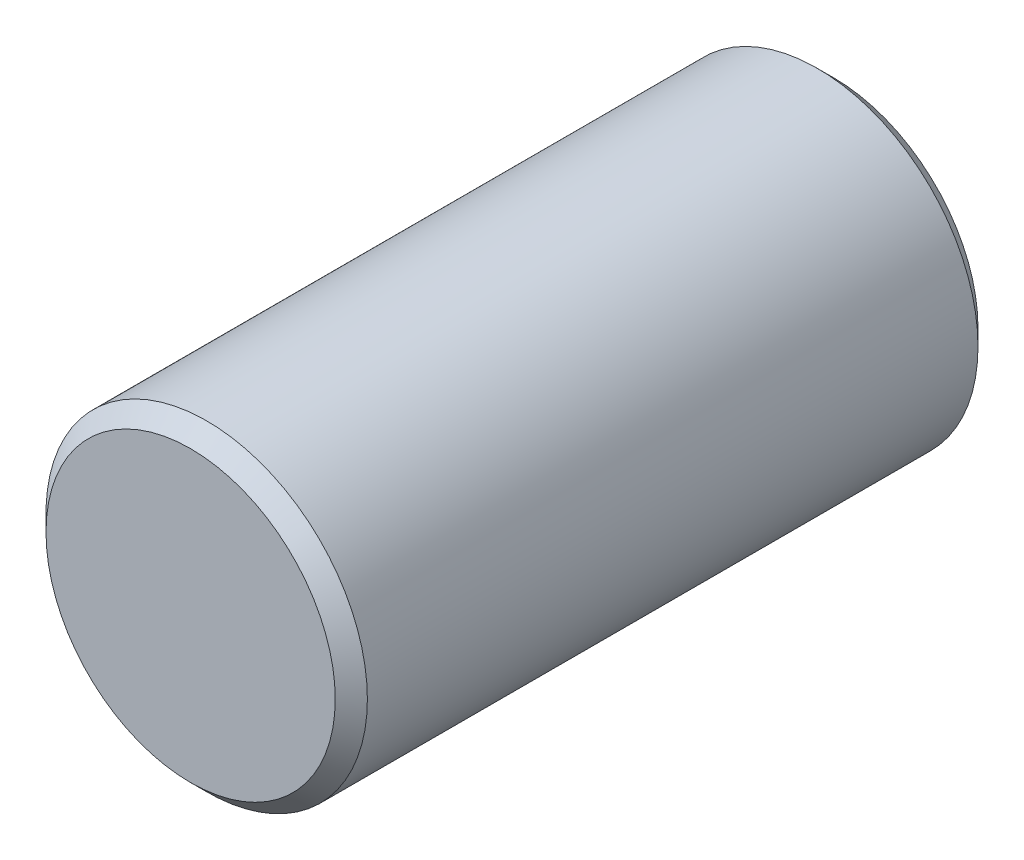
from build123d import *

# Parameters (mm, degrees)
ESQUISSE1_R      = 1
EXTRUSION1_DEPTH = 4
CHANFREIN1_SIZE  = 0.1


with BuildPart() as part:
    # Esquisse1 → Extrusion1 (new body)
    with BuildSketch(Plane.XY):
        Circle(ESQUISSE1_R)
    extrude(amount=EXTRUSION1_DEPTH)

    # Chanfrein1
    chanfrein1_edges = [part.edges().sort_by_distance(p)[0] for p in [
        (-1, 0, 0),
        (-1, 0, 4),
    ]]
    chamfer(chanfrein1_edges, length=CHANFREIN1_SIZE)


solid = part.part
